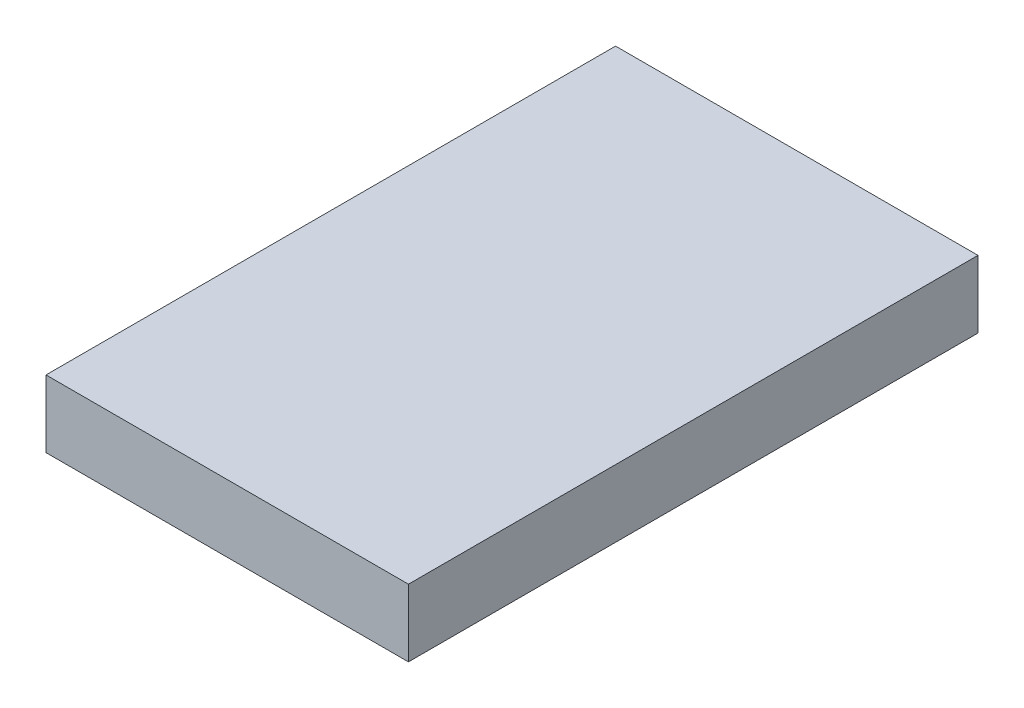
from build123d import *

# Parameters (mm, degrees)
CROQUIS1_W     = 70
CROQUIS1_H     = 110
EXTRUIR1_DEPTH = 13


with BuildPart() as part:
    # Croquis1 → Extruir1 (new body)
    with BuildSketch(Plane(origin=(0, 0, 0), x_dir=(1, 0, 0), z_dir=(0, 1, 0))):
        Rectangle(CROQUIS1_W, CROQUIS1_H)
    extrude(amount=EXTRUIR1_DEPTH)


solid = part.part
